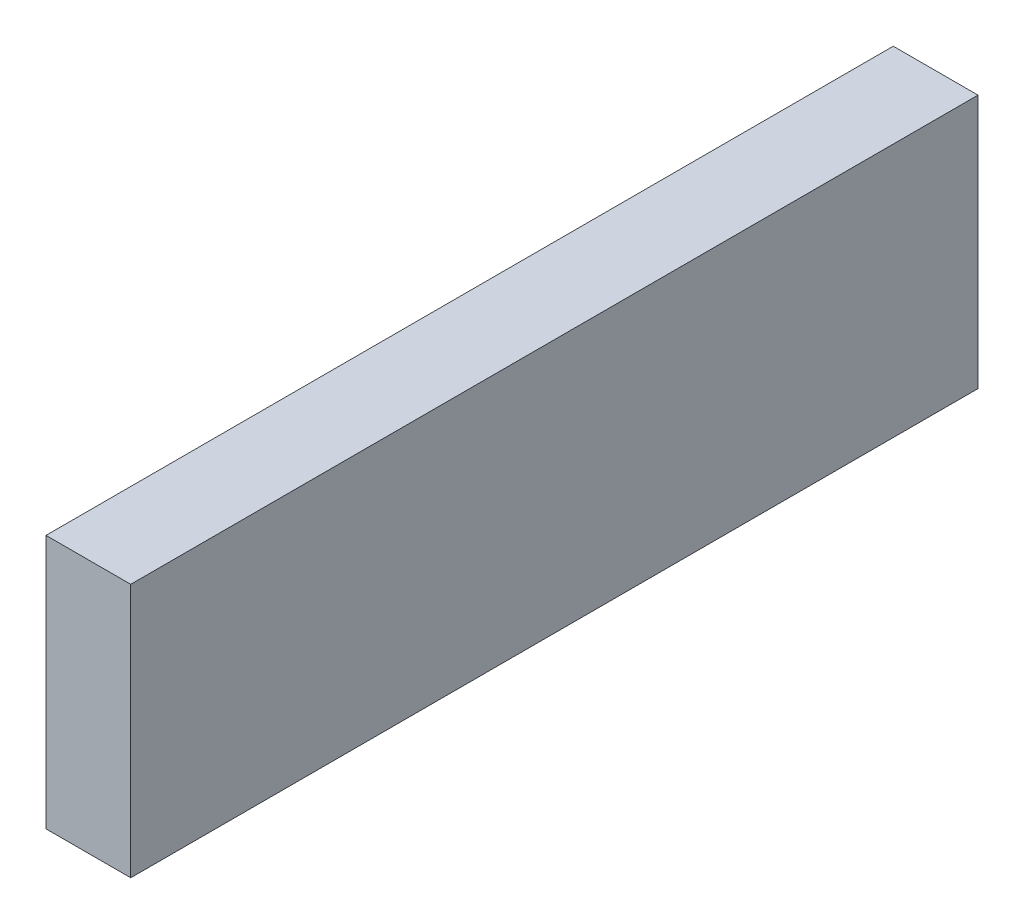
from build123d import *

# Parameters (mm, degrees)
ESQUISSE1_W          = 10
ESQUISSE1_H          = 30
BASE_EXTRUSION_DEPTH = 100


with BuildPart() as part:
    # Esquisse1 → Base-Extrusion (new body)
    with BuildSketch(Plane.XY):
        with Locations((-5, 15)):
            Rectangle(ESQUISSE1_W, ESQUISSE1_H)
    extrude(amount=BASE_EXTRUSION_DEPTH)


solid = part.part
